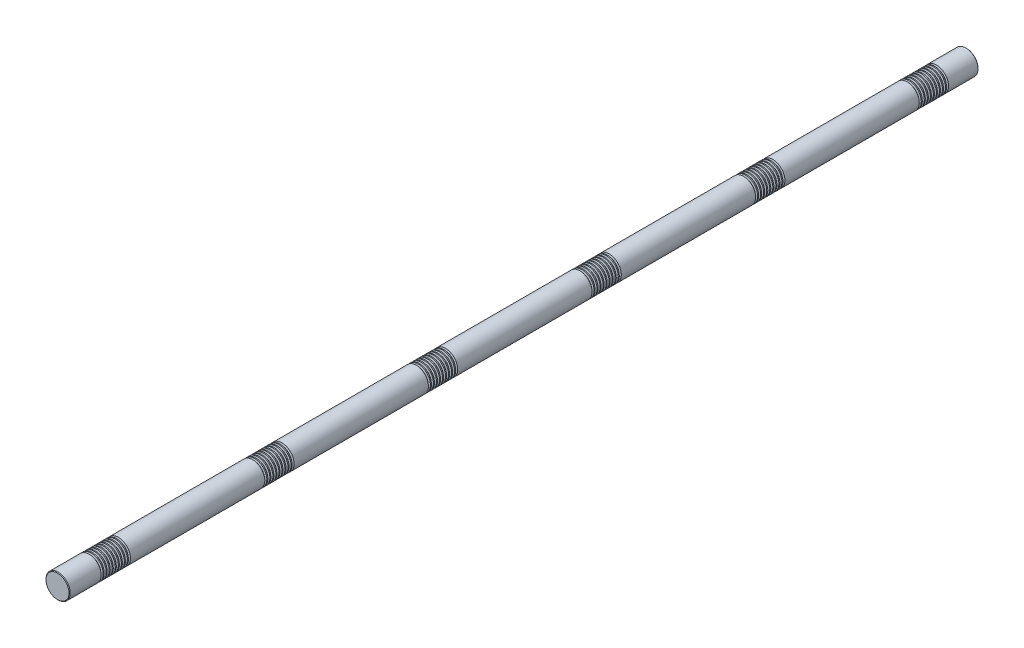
from build123d import *

# Parameters (mm, degrees)
SKETCH1_R           = 40
BOSS_EXTRUDE1_DEPTH = 1500
CHAMFER1_SIZE       = 2
LPATTERN1_COUNT     = 10
LPATTERN1_PITCH     = 10
LPATTERN2_COUNT     = 6
LPATTERN2_PITCH     = 540


with BuildPart() as part:
    # Sketch1 → Boss-Extrude1 (new, symmetric)
    with BuildSketch(Plane.XY):
        Circle(SKETCH1_R)
    extrude(amount=BOSS_EXTRUDE1_DEPTH, both=True)

    # Chamfer1
    chamfer1_edges = [part.edges().sort_by_distance(p)[0] for p in [
        (-40, 0, -1500),
        (-40, 0, 1500),
    ]]
    chamfer(chamfer1_edges, length=CHAMFER1_SIZE)

    # Sketch2 → Cut-Revolve1 (revolve, cut)
    with BuildSketch(Plane(origin=(0, 0, 0), x_dir=(0, 0, -1), z_dir=(1, 0, 0)), mode=Mode.PRIVATE) as cut_revolve1_sk:
        Polygon((1400.803847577, 40), (1394.196152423, 40), (1395.803847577, 34), (1399.196152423, 34), align=None)
    cut_revolve1 = revolve(cut_revolve1_sk.sketch.rotate(Axis((0, 0, 1500), (0, 0, -1)), 90), axis=Axis((0, 0, 1500), (0, 0, -1)), mode=Mode.SUBTRACT)

    # LPattern1: Cut-Revolve1 ×10
    with Locations(*[(0, 0, i * LPATTERN1_PITCH) for i in range(1, LPATTERN1_COUNT)]):
        add(cut_revolve1, mode=Mode.SUBTRACT)

    # LPattern2: Cut-Revolve1 ×6
    with Locations(*[(0, 0, i * LPATTERN2_PITCH) for i in range(1, LPATTERN2_COUNT)]):
        add(cut_revolve1, mode=Mode.SUBTRACT)

    # LPattern2 copy 1 sketch → LPattern2 copy 1 (revolve, cut)
    with BuildSketch(Plane(origin=(0, 0, 550), x_dir=(0, 0, -1), z_dir=(1, 0, 0))):
        Polygon((1400.803847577, 40), (1394.196152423, 40), (1395.803847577, 34), (1399.196152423, 34), align=None)
    revolve(axis=Axis((0, 0, 2050), (0, 0, -1)), mode=Mode.SUBTRACT)

    # LPattern2 copy 2 sketch → LPattern2 copy 2 (revolve, cut)
    with BuildSketch(Plane(origin=(0, 0, 1090), x_dir=(0, 0, -1), z_dir=(1, 0, 0))):
        Polygon((1400.803847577, 40), (1394.196152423, 40), (1395.803847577, 34), (1399.196152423, 34), align=None)
    revolve(axis=Axis((0, 0, 2590), (0, 0, -1)), mode=Mode.SUBTRACT)

    # LPattern2 copy 3 sketch → LPattern2 copy 3 (revolve, cut)
    with BuildSketch(Plane(origin=(0, 0, 1630), x_dir=(0, 0, -1), z_dir=(1, 0, 0))):
        Polygon((1400.803847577, 40), (1394.196152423, 40), (1395.803847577, 34), (1399.196152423, 34), align=None)
    revolve(axis=Axis((0, 0, 3130), (0, 0, -1)), mode=Mode.SUBTRACT)

    # LPattern2 copy 4 sketch → LPattern2 copy 4 (revolve, cut)
    with BuildSketch(Plane(origin=(0, 0, 2170), x_dir=(0, 0, -1), z_dir=(1, 0, 0))):
        Polygon((1400.803847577, 40), (1394.196152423, 40), (1395.803847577, 34), (1399.196152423, 34), align=None)
    revolve(axis=Axis((0, 0, 3670), (0, 0, -1)), mode=Mode.SUBTRACT)

    # LPattern2 copy 5 sketch → LPattern2 copy 5 (revolve, cut)
    with BuildSketch(Plane(origin=(0, 0, 2710), x_dir=(0, 0, -1), z_dir=(1, 0, 0))):
        Polygon((1400.803847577, 40), (1394.196152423, 40), (1395.803847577, 34), (1399.196152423, 34), align=None)
    revolve(axis=Axis((0, 0, 4210), (0, 0, -1)), mode=Mode.SUBTRACT)

    # LPattern2 copy 6 sketch → LPattern2 copy 6 (revolve, cut)
    with BuildSketch(Plane(origin=(0, 0, 560), x_dir=(0, 0, -1), z_dir=(1, 0, 0))):
        Polygon((1400.803847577, 40), (1394.196152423, 40), (1395.803847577, 34), (1399.196152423, 34), align=None)
    revolve(axis=Axis((0, 0, 2060), (0, 0, -1)), mode=Mode.SUBTRACT)

    # LPattern2 copy 7 sketch → LPattern2 copy 7 (revolve, cut)
    with BuildSketch(Plane(origin=(0, 0, 1100), x_dir=(0, 0, -1), z_dir=(1, 0, 0))):
        Polygon((1400.803847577, 40), (1394.196152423, 40), (1395.803847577, 34), (1399.196152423, 34), align=None)
    revolve(axis=Axis((0, 0, 2600), (0, 0, -1)), mode=Mode.SUBTRACT)

    # LPattern2 copy 8 sketch → LPattern2 copy 8 (revolve, cut)
    with BuildSketch(Plane(origin=(0, 0, 1640), x_dir=(0, 0, -1), z_dir=(1, 0, 0))):
        Polygon((1400.803847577, 40), (1394.196152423, 40), (1395.803847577, 34), (1399.196152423, 34), align=None)
    revolve(axis=Axis((0, 0, 3140), (0, 0, -1)), mode=Mode.SUBTRACT)

    # LPattern2 copy 9 sketch → LPattern2 copy 9 (revolve, cut)
    with BuildSketch(Plane(origin=(0, 0, 2180), x_dir=(0, 0, -1), z_dir=(1, 0, 0))):
        Polygon((1400.803847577, 40), (1394.196152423, 40), (1395.803847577, 34), (1399.196152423, 34), align=None)
    revolve(axis=Axis((0, 0, 3680), (0, 0, -1)), mode=Mode.SUBTRACT)

    # LPattern2 copy 10 sketch → LPattern2 copy 10 (revolve, cut)
    with BuildSketch(Plane(origin=(0, 0, 2720), x_dir=(0, 0, -1), z_dir=(1, 0, 0))):
        Polygon((1400.803847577, 40), (1394.196152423, 40), (1395.803847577, 34), (1399.196152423, 34), align=None)
    revolve(axis=Axis((0, 0, 4220), (0, 0, -1)), mode=Mode.SUBTRACT)

    # LPattern2 copy 11 sketch → LPattern2 copy 11 (revolve, cut)
    with BuildSketch(Plane(origin=(0, 0, 570), x_dir=(0, 0, -1), z_dir=(1, 0, 0))):
        Polygon((1400.803847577, 40), (1394.196152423, 40), (1395.803847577, 34), (1399.196152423, 34), align=None)
    revolve(axis=Axis((0, 0, 2070), (0, 0, -1)), mode=Mode.SUBTRACT)

    # LPattern2 copy 12 sketch → LPattern2 copy 12 (revolve, cut)
    with BuildSketch(Plane(origin=(0, 0, 1110), x_dir=(0, 0, -1), z_dir=(1, 0, 0))):
        Polygon((1400.803847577, 40), (1394.196152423, 40), (1395.803847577, 34), (1399.196152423, 34), align=None)
    revolve(axis=Axis((0, 0, 2610), (0, 0, -1)), mode=Mode.SUBTRACT)

    # LPattern2 copy 13 sketch → LPattern2 copy 13 (revolve, cut)
    with BuildSketch(Plane(origin=(0, 0, 1650), x_dir=(0, 0, -1), z_dir=(1, 0, 0))):
        Polygon((1400.803847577, 40), (1394.196152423, 40), (1395.803847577, 34), (1399.196152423, 34), align=None)
    revolve(axis=Axis((0, 0, 3150), (0, 0, -1)), mode=Mode.SUBTRACT)

    # LPattern2 copy 14 sketch → LPattern2 copy 14 (revolve, cut)
    with BuildSketch(Plane(origin=(0, 0, 2190), x_dir=(0, 0, -1), z_dir=(1, 0, 0))):
        Polygon((1400.803847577, 40), (1394.196152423, 40), (1395.803847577, 34), (1399.196152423, 34), align=None)
    revolve(axis=Axis((0, 0, 3690), (0, 0, -1)), mode=Mode.SUBTRACT)

    # LPattern2 copy 15 sketch → LPattern2 copy 15 (revolve, cut)
    with BuildSketch(Plane(origin=(0, 0, 2730), x_dir=(0, 0, -1), z_dir=(1, 0, 0))):
        Polygon((1400.803847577, 40), (1394.196152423, 40), (1395.803847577, 34), (1399.196152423, 34), align=None)
    revolve(axis=Axis((0, 0, 4230), (0, 0, -1)), mode=Mode.SUBTRACT)

    # LPattern2 copy 16 sketch → LPattern2 copy 16 (revolve, cut)
    with BuildSketch(Plane(origin=(0, 0, 580), x_dir=(0, 0, -1), z_dir=(1, 0, 0))):
        Polygon((1400.803847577, 40), (1394.196152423, 40), (1395.803847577, 34), (1399.196152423, 34), align=None)
    revolve(axis=Axis((0, 0, 2080), (0, 0, -1)), mode=Mode.SUBTRACT)

    # LPattern2 copy 17 sketch → LPattern2 copy 17 (revolve, cut)
    with BuildSketch(Plane(origin=(0, 0, 1120), x_dir=(0, 0, -1), z_dir=(1, 0, 0))):
        Polygon((1400.803847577, 40), (1394.196152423, 40), (1395.803847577, 34), (1399.196152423, 34), align=None)
    revolve(axis=Axis((0, 0, 2620), (0, 0, -1)), mode=Mode.SUBTRACT)

    # LPattern2 copy 18 sketch → LPattern2 copy 18 (revolve, cut)
    with BuildSketch(Plane(origin=(0, 0, 1660), x_dir=(0, 0, -1), z_dir=(1, 0, 0))):
        Polygon((1400.803847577, 40), (1394.196152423, 40), (1395.803847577, 34), (1399.196152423, 34), align=None)
    revolve(axis=Axis((0, 0, 3160), (0, 0, -1)), mode=Mode.SUBTRACT)

    # LPattern2 copy 19 sketch → LPattern2 copy 19 (revolve, cut)
    with BuildSketch(Plane(origin=(0, 0, 2200), x_dir=(0, 0, -1), z_dir=(1, 0, 0))):
        Polygon((1400.803847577, 40), (1394.196152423, 40), (1395.803847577, 34), (1399.196152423, 34), align=None)
    revolve(axis=Axis((0, 0, 3700), (0, 0, -1)), mode=Mode.SUBTRACT)

    # LPattern2 copy 20 sketch → LPattern2 copy 20 (revolve, cut)
    with BuildSketch(Plane(origin=(0, 0, 2740), x_dir=(0, 0, -1), z_dir=(1, 0, 0))):
        Polygon((1400.803847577, 40), (1394.196152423, 40), (1395.803847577, 34), (1399.196152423, 34), align=None)
    revolve(axis=Axis((0, 0, 4240), (0, 0, -1)), mode=Mode.SUBTRACT)

    # LPattern2 copy 21 sketch → LPattern2 copy 21 (revolve, cut)
    with BuildSketch(Plane(origin=(0, 0, 590), x_dir=(0, 0, -1), z_dir=(1, 0, 0))):
        Polygon((1400.803847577, 40), (1394.196152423, 40), (1395.803847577, 34), (1399.196152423, 34), align=None)
    revolve(axis=Axis((0, 0, 2090), (0, 0, -1)), mode=Mode.SUBTRACT)

    # LPattern2 copy 22 sketch → LPattern2 copy 22 (revolve, cut)
    with BuildSketch(Plane(origin=(0, 0, 1130), x_dir=(0, 0, -1), z_dir=(1, 0, 0))):
        Polygon((1400.803847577, 40), (1394.196152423, 40), (1395.803847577, 34), (1399.196152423, 34), align=None)
    revolve(axis=Axis((0, 0, 2630), (0, 0, -1)), mode=Mode.SUBTRACT)

    # LPattern2 copy 23 sketch → LPattern2 copy 23 (revolve, cut)
    with BuildSketch(Plane(origin=(0, 0, 1670), x_dir=(0, 0, -1), z_dir=(1, 0, 0))):
        Polygon((1400.803847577, 40), (1394.196152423, 40), (1395.803847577, 34), (1399.196152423, 34), align=None)
    revolve(axis=Axis((0, 0, 3170), (0, 0, -1)), mode=Mode.SUBTRACT)

    # LPattern2 copy 24 sketch → LPattern2 copy 24 (revolve, cut)
    with BuildSketch(Plane(origin=(0, 0, 2210), x_dir=(0, 0, -1), z_dir=(1, 0, 0))):
        Polygon((1400.803847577, 40), (1394.196152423, 40), (1395.803847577, 34), (1399.196152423, 34), align=None)
    revolve(axis=Axis((0, 0, 3710), (0, 0, -1)), mode=Mode.SUBTRACT)

    # LPattern2 copy 25 sketch → LPattern2 copy 25 (revolve, cut)
    with BuildSketch(Plane(origin=(0, 0, 2750), x_dir=(0, 0, -1), z_dir=(1, 0, 0))):
        Polygon((1400.803847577, 40), (1394.196152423, 40), (1395.803847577, 34), (1399.196152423, 34), align=None)
    revolve(axis=Axis((0, 0, 4250), (0, 0, -1)), mode=Mode.SUBTRACT)

    # LPattern2 copy 26 sketch → LPattern2 copy 26 (revolve, cut)
    with BuildSketch(Plane(origin=(0, 0, 600), x_dir=(0, 0, -1), z_dir=(1, 0, 0))):
        Polygon((1400.803847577, 40), (1394.196152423, 40), (1395.803847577, 34), (1399.196152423, 34), align=None)
    revolve(axis=Axis((0, 0, 2100), (0, 0, -1)), mode=Mode.SUBTRACT)

    # LPattern2 copy 27 sketch → LPattern2 copy 27 (revolve, cut)
    with BuildSketch(Plane(origin=(0, 0, 1140), x_dir=(0, 0, -1), z_dir=(1, 0, 0))):
        Polygon((1400.803847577, 40), (1394.196152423, 40), (1395.803847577, 34), (1399.196152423, 34), align=None)
    revolve(axis=Axis((0, 0, 2640), (0, 0, -1)), mode=Mode.SUBTRACT)

    # LPattern2 copy 28 sketch → LPattern2 copy 28 (revolve, cut)
    with BuildSketch(Plane(origin=(0, 0, 1680), x_dir=(0, 0, -1), z_dir=(1, 0, 0))):
        Polygon((1400.803847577, 40), (1394.196152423, 40), (1395.803847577, 34), (1399.196152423, 34), align=None)
    revolve(axis=Axis((0, 0, 3180), (0, 0, -1)), mode=Mode.SUBTRACT)

    # LPattern2 copy 29 sketch → LPattern2 copy 29 (revolve, cut)
    with BuildSketch(Plane(origin=(0, 0, 2220), x_dir=(0, 0, -1), z_dir=(1, 0, 0))):
        Polygon((1400.803847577, 40), (1394.196152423, 40), (1395.803847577, 34), (1399.196152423, 34), align=None)
    revolve(axis=Axis((0, 0, 3720), (0, 0, -1)), mode=Mode.SUBTRACT)

    # LPattern2 copy 30 sketch → LPattern2 copy 30 (revolve, cut)
    with BuildSketch(Plane(origin=(0, 0, 2760), x_dir=(0, 0, -1), z_dir=(1, 0, 0))):
        Polygon((1400.803847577, 40), (1394.196152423, 40), (1395.803847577, 34), (1399.196152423, 34), align=None)
    revolve(axis=Axis((0, 0, 4260), (0, 0, -1)), mode=Mode.SUBTRACT)

    # LPattern2 copy 31 sketch → LPattern2 copy 31 (revolve, cut)
    with BuildSketch(Plane(origin=(0, 0, 610), x_dir=(0, 0, -1), z_dir=(1, 0, 0))):
        Polygon((1400.803847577, 40), (1394.196152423, 40), (1395.803847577, 34), (1399.196152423, 34), align=None)
    revolve(axis=Axis((0, 0, 2110), (0, 0, -1)), mode=Mode.SUBTRACT)

    # LPattern2 copy 32 sketch → LPattern2 copy 32 (revolve, cut)
    with BuildSketch(Plane(origin=(0, 0, 1150), x_dir=(0, 0, -1), z_dir=(1, 0, 0))):
        Polygon((1400.803847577, 40), (1394.196152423, 40), (1395.803847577, 34), (1399.196152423, 34), align=None)
    revolve(axis=Axis((0, 0, 2650), (0, 0, -1)), mode=Mode.SUBTRACT)

    # LPattern2 copy 33 sketch → LPattern2 copy 33 (revolve, cut)
    with BuildSketch(Plane(origin=(0, 0, 1690), x_dir=(0, 0, -1), z_dir=(1, 0, 0))):
        Polygon((1400.803847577, 40), (1394.196152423, 40), (1395.803847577, 34), (1399.196152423, 34), align=None)
    revolve(axis=Axis((0, 0, 3190), (0, 0, -1)), mode=Mode.SUBTRACT)

    # LPattern2 copy 34 sketch → LPattern2 copy 34 (revolve, cut)
    with BuildSketch(Plane(origin=(0, 0, 2230), x_dir=(0, 0, -1), z_dir=(1, 0, 0))):
        Polygon((1400.803847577, 40), (1394.196152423, 40), (1395.803847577, 34), (1399.196152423, 34), align=None)
    revolve(axis=Axis((0, 0, 3730), (0, 0, -1)), mode=Mode.SUBTRACT)

    # LPattern2 copy 35 sketch → LPattern2 copy 35 (revolve, cut)
    with BuildSketch(Plane(origin=(0, 0, 2770), x_dir=(0, 0, -1), z_dir=(1, 0, 0))):
        Polygon((1400.803847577, 40), (1394.196152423, 40), (1395.803847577, 34), (1399.196152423, 34), align=None)
    revolve(axis=Axis((0, 0, 4270), (0, 0, -1)), mode=Mode.SUBTRACT)

    # LPattern2 copy 36 sketch → LPattern2 copy 36 (revolve, cut)
    with BuildSketch(Plane(origin=(0, 0, 620), x_dir=(0, 0, -1), z_dir=(1, 0, 0))):
        Polygon((1400.803847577, 40), (1394.196152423, 40), (1395.803847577, 34), (1399.196152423, 34), align=None)
    revolve(axis=Axis((0, 0, 2120), (0, 0, -1)), mode=Mode.SUBTRACT)

    # LPattern2 copy 37 sketch → LPattern2 copy 37 (revolve, cut)
    with BuildSketch(Plane(origin=(0, 0, 1160), x_dir=(0, 0, -1), z_dir=(1, 0, 0))):
        Polygon((1400.803847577, 40), (1394.196152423, 40), (1395.803847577, 34), (1399.196152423, 34), align=None)
    revolve(axis=Axis((0, 0, 2660), (0, 0, -1)), mode=Mode.SUBTRACT)

    # LPattern2 copy 38 sketch → LPattern2 copy 38 (revolve, cut)
    with BuildSketch(Plane(origin=(0, 0, 1700), x_dir=(0, 0, -1), z_dir=(1, 0, 0))):
        Polygon((1400.803847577, 40), (1394.196152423, 40), (1395.803847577, 34), (1399.196152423, 34), align=None)
    revolve(axis=Axis((0, 0, 3200), (0, 0, -1)), mode=Mode.SUBTRACT)

    # LPattern2 copy 39 sketch → LPattern2 copy 39 (revolve, cut)
    with BuildSketch(Plane(origin=(0, 0, 2240), x_dir=(0, 0, -1), z_dir=(1, 0, 0))):
        Polygon((1400.803847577, 40), (1394.196152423, 40), (1395.803847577, 34), (1399.196152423, 34), align=None)
    revolve(axis=Axis((0, 0, 3740), (0, 0, -1)), mode=Mode.SUBTRACT)

    # LPattern2 copy 40 sketch → LPattern2 copy 40 (revolve, cut)
    with BuildSketch(Plane(origin=(0, 0, 2780), x_dir=(0, 0, -1), z_dir=(1, 0, 0))):
        Polygon((1400.803847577, 40), (1394.196152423, 40), (1395.803847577, 34), (1399.196152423, 34), align=None)
    revolve(axis=Axis((0, 0, 4280), (0, 0, -1)), mode=Mode.SUBTRACT)

    # LPattern2 copy 41 sketch → LPattern2 copy 41 (revolve, cut)
    with BuildSketch(Plane(origin=(0, 0, 630), x_dir=(0, 0, -1), z_dir=(1, 0, 0))):
        Polygon((1400.803847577, 40), (1394.196152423, 40), (1395.803847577, 34), (1399.196152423, 34), align=None)
    revolve(axis=Axis((0, 0, 2130), (0, 0, -1)), mode=Mode.SUBTRACT)

    # LPattern2 copy 42 sketch → LPattern2 copy 42 (revolve, cut)
    with BuildSketch(Plane(origin=(0, 0, 1170), x_dir=(0, 0, -1), z_dir=(1, 0, 0))):
        Polygon((1400.803847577, 40), (1394.196152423, 40), (1395.803847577, 34), (1399.196152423, 34), align=None)
    revolve(axis=Axis((0, 0, 2670), (0, 0, -1)), mode=Mode.SUBTRACT)

    # LPattern2 copy 43 sketch → LPattern2 copy 43 (revolve, cut)
    with BuildSketch(Plane(origin=(0, 0, 1710), x_dir=(0, 0, -1), z_dir=(1, 0, 0))):
        Polygon((1400.803847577, 40), (1394.196152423, 40), (1395.803847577, 34), (1399.196152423, 34), align=None)
    revolve(axis=Axis((0, 0, 3210), (0, 0, -1)), mode=Mode.SUBTRACT)

    # LPattern2 copy 44 sketch → LPattern2 copy 44 (revolve, cut)
    with BuildSketch(Plane(origin=(0, 0, 2250), x_dir=(0, 0, -1), z_dir=(1, 0, 0))):
        Polygon((1400.803847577, 40), (1394.196152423, 40), (1395.803847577, 34), (1399.196152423, 34), align=None)
    revolve(axis=Axis((0, 0, 3750), (0, 0, -1)), mode=Mode.SUBTRACT)

    # LPattern2 copy 45 sketch → LPattern2 copy 45 (revolve, cut)
    with BuildSketch(Plane(origin=(0, 0, 2790), x_dir=(0, 0, -1), z_dir=(1, 0, 0))):
        Polygon((1400.803847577, 40), (1394.196152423, 40), (1395.803847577, 34), (1399.196152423, 34), align=None)
    revolve(axis=Axis((0, 0, 4290), (0, 0, -1)), mode=Mode.SUBTRACT)


solid = part.part
